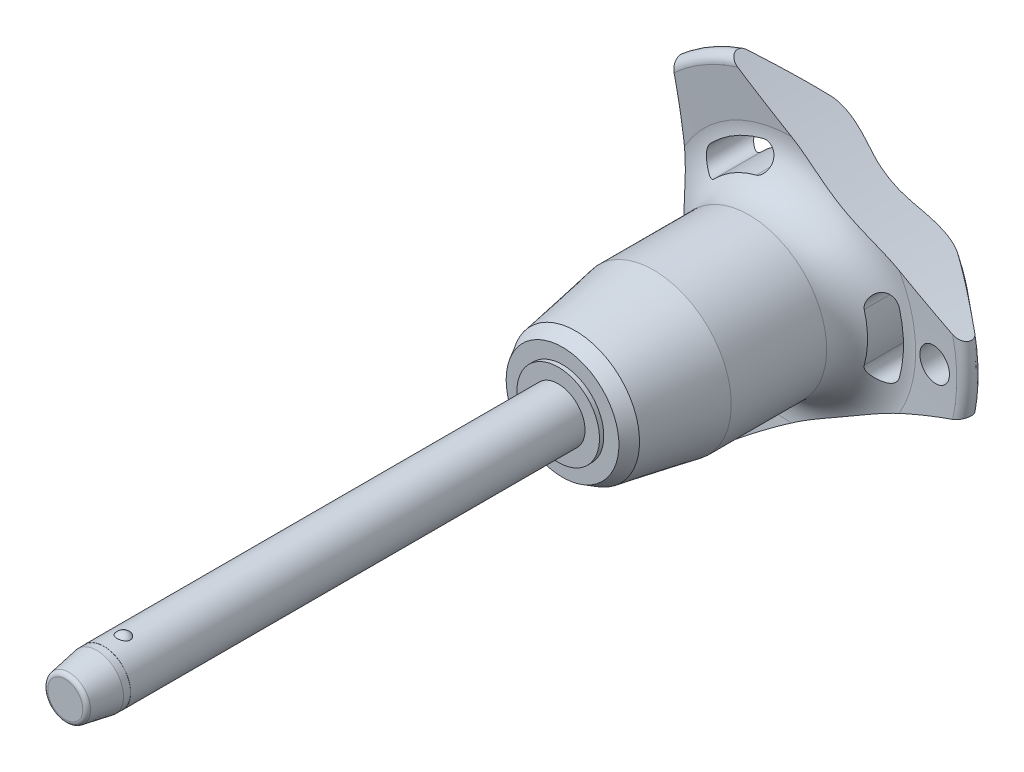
from build123d import *

# Parameters (mm, degrees)
SKETCH1_R           = 2.5
BOSS_EXTRUDE1_DEPTH = 40
SKETCH2_R           = 2.1
BOSS_EXTRUDE2_DEPTH = 26.7
BOSS_EXTRUDE3_START = 6
SKETCH1_2_R         = 2.5
BOSS_EXTRUDE3_DEPTH = 6
CHAMFER1_SIZE       = 3
CHAMFER1_SIZE2      = 0.528980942
FILLET1_R           = 0.4
SKETCH6_R           = 79.96
CUT_EXTRUDE1_DEPTH  = 71.711449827
CIRPATTERN1_COUNT   = 3
SKETCH7_R           = 1.5
CUT_EXTRUDE2_DEPTH  = 71.495866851
SKETCH8_R           = 2.5
SKETCH8_R_2         = 2.49
CUT_EXTRUDE3_DEPTH  = 3.6


with BuildPart() as part:
    # Sketch1 → Boss-Extrude1 (new body)
    with BuildSketch(Plane.XY):
        Circle(SKETCH1_R)
    extrude(amount=-BOSS_EXTRUDE1_DEPTH)

    # Sketch2 → Boss-Extrude2 (add)
    with BuildSketch(Plane(origin=(0, 0, -40), x_dir=(-1, 0, 0), z_dir=(0, 0, -1))):
        Circle(SKETCH2_R)
    extrude(amount=BOSS_EXTRUDE2_DEPTH)

    # Sketch3 → Revolve1 (revolve)
    with BuildSketch(Plane(origin=(0, 0, 0), x_dir=(0, 0, -1), z_dir=(1, 0, 0))):
        with BuildLine():
            Line((-0.580947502, 2.75), (-0.580947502, 1.15))
            ThreePointArc((-0.580947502, 1.15), (0.219052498, 1.95), (-0.580947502, 2.75))
        make_face()
        with BuildLine():
            Line((-0.580947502, -1.15), (-0.580947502, -2.75))
            ThreePointArc((-0.580947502, -2.75), (0.219052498, -1.95), (-0.580947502, -1.15))
        make_face()
    revolve(axis=Axis((0, -1.15, 0.580947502), (0, 1, 0)))

    # Sketch1_2 → Boss-Extrude3 (add)
    with BuildSketch(Plane.XY.offset(BOSS_EXTRUDE3_START)):
        Circle(SKETCH1_2_R)
    extrude(amount=-BOSS_EXTRUDE3_DEPTH)

    # Chamfer1
    chamfer1_edges = [part.edges().sort_by_distance(p)[0] for p in [
        (-2.5, 0, 6),
    ]]
    chamfer1_side = [part.faces().sort_by_distance(p)[0] for p in [
        (-2.5, 0, -17),
    ]]
    chamfer(chamfer1_edges, length=CHAMFER1_SIZE, length2=CHAMFER1_SIZE2, reference=chamfer1_side[0])

    # Fillet1
    fillet1_edges = [part.edges().sort_by_distance(p)[0] for p in [
        (-1.971019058, 0, 6),
        (2.1, 0, -66.7),
    ]]
    fillet(fillet1_edges, radius=FILLET1_R)

    # Sketch4 → Revolve2 (revolve)
    with BuildSketch(Plane(origin=(0, 0, 0), x_dir=(0, 0, -1), z_dir=(1, 0, 0)), mode=Mode.PRIVATE) as revolve2_sk:
        Polygon((40, 0), (40, 3.851837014), (40.4, 3.851837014), (40.4, 5.26161122), (41.620900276, 5.966498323), (48.9, 7.25), (57.8, 7.25), (57.8, 0), align=None)
    revolve(revolve2_sk.sketch.rotate(Axis((0, 0, -57.8), (0, 0, 1)), 90), axis=Axis((0, 0, -57.8), (0, 0, 1)))

    # Sketch5 → Revolve3 (revolve)
    with BuildSketch(Plane(origin=(0, 0, 0), x_dir=(0, 0, -1), z_dir=(1, 0, 0)), mode=Mode.PRIVATE) as revolve3_sk:
        with BuildLine():
            Line((61.78715932, 11.570250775), (61.452568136, 15.735949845))
            ThreePointArc((61.452568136, 15.735949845), (61.946485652, 16.540188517), (62.862835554, 16.314230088))
            Line((62.862835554, 16.314230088), (66.326414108, 12.186497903))
            ThreePointArc((66.326414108, 12.186497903), (66.7, 11.109282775), (66.261488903, 10.056825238))
            ThreePointArc((66.261488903, 10.056825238), (63.289873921, 5.413681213), (62.25, 0))
            Line((62.25, 0), (57.8, 0))
            Line((57.8, 0), (57.8, 7.25))
            ThreePointArc((57.8, 7.25), (60.739473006, 8.537160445), (61.78715932, 11.570250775))
        make_face()
    revolve(revolve3_sk.sketch.rotate(Axis((0, 0, -62.25), (0, 0, 1)), 90), axis=Axis((0, 0, -62.25), (0, 0, 1)))

    # Sketch6 → Cut-Extrude1 (cut, through all)
    with BuildSketch(Plane.XY):
        with Locations((-89.76, 0)):
            Circle(SKETCH6_R)
        with BuildLine():
            ThreePointArc((10.099921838, -2.834717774), (10.490188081, 0), (10.099921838, 2.834717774))
            ThreePointArc((10.099921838, 2.834717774), (8.768180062, 3.582738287), (8.020159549, 2.250996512))
            ThreePointArc((8.020159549, 2.250996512), (8.330062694, 0), (8.020159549, -2.250996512))
            ThreePointArc((8.020159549, -2.250996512), (8.768180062, -3.582738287), (10.099921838, -2.834717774))
        make_face()
    cut_extrude1 = extrude(amount=-CUT_EXTRUDE1_DEPTH, mode=Mode.SUBTRACT)

    # CirPattern1: Cut-Extrude1 ×3 about axis
    cirpattern1_axis = Axis((0, 0, 0), (0, 0, 1))
    for i in range(1, CIRPATTERN1_COUNT):
        add(cut_extrude1.rotate(cirpattern1_axis, i * 360 / CIRPATTERN1_COUNT), mode=Mode.SUBTRACT)

    # Sketch7 → Cut-Extrude2 (cut, through all)
    with BuildSketch(Plane.XY):
        with Locations(Location((13.490188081, 0, 0), (0, 0, 225.221865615))):
            Circle(SKETCH7_R)
    extrude(amount=-CUT_EXTRUDE2_DEPTH, mode=Mode.SUBTRACT)

    # Sketch8 → Cut-Extrude3 (cut)
    with BuildSketch(Plane.XY.offset(6)):
        Circle(SKETCH8_R)
        Circle(SKETCH8_R_2, mode=Mode.SUBTRACT)
    extrude(amount=-CUT_EXTRUDE3_DEPTH, mode=Mode.SUBTRACT)


solid = part.part
